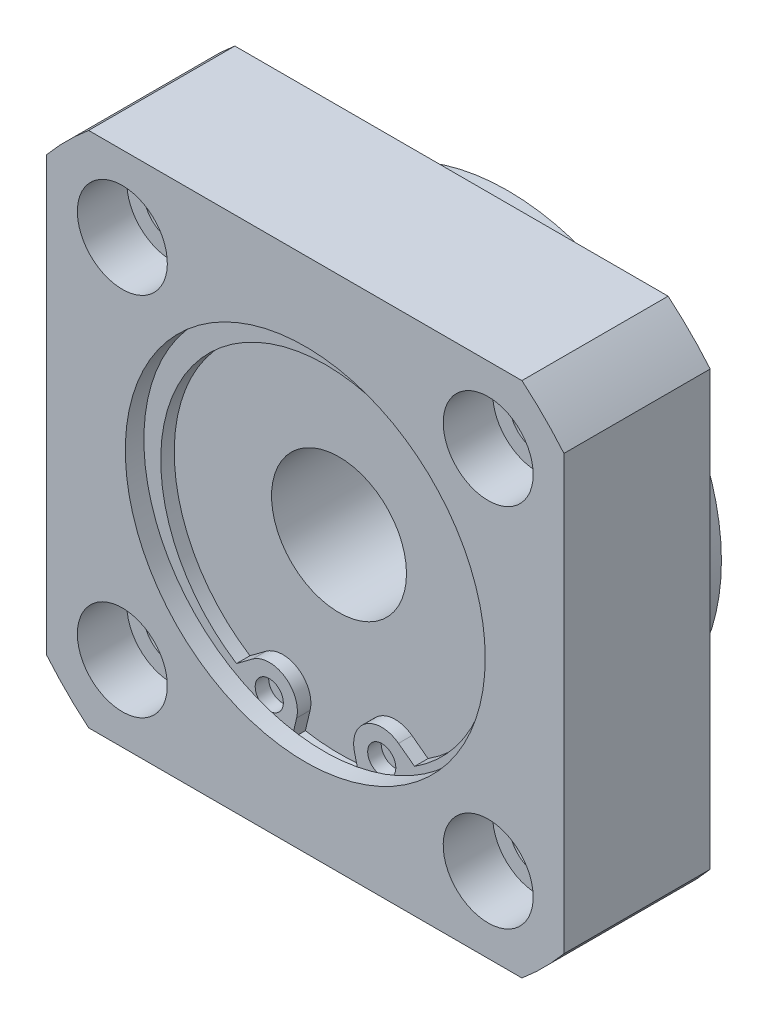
ISO-10303-21;
HEADER;
FILE_DESCRIPTION(('STEP AP214'),'2;1');
FILE_NAME('part.step','',(''),(''),'','','');
FILE_SCHEMA(('AUTOMOTIVE_DESIGN { 1 0 10303 214 1 1 1 1 }'));
ENDSEC;
DATA;
#1=APPLICATION_CONTEXT('core data for automotive mechanical design processes');
#2=APPLICATION_PROTOCOL_DEFINITION('international standard','automotive_design',2000,#1);
#3=PRODUCT_CONTEXT('',#1,'mechanical');
#4=PRODUCT('Part','Part','',(#3));
#5=PRODUCT_RELATED_PRODUCT_CATEGORY('part','',(#4));
#6=PRODUCT_DEFINITION_FORMATION('','',#4);
#7=PRODUCT_DEFINITION_CONTEXT('part definition',#1,'design');
#8=PRODUCT_DEFINITION('design','',#6,#7);
#9=PRODUCT_DEFINITION_SHAPE('','',#8);
#10=(LENGTH_UNIT() NAMED_UNIT(*) SI_UNIT(.MILLI.,.METRE.));
#11=(NAMED_UNIT(*) PLANE_ANGLE_UNIT() SI_UNIT($,.RADIAN.));
#12=(NAMED_UNIT(*) SI_UNIT($,.STERADIAN.) SOLID_ANGLE_UNIT());
#13=UNCERTAINTY_MEASURE_WITH_UNIT(LENGTH_MEASURE(1.E-05),#10,'distance_accuracy_value','');
#14=(GEOMETRIC_REPRESENTATION_CONTEXT(3) GLOBAL_UNCERTAINTY_ASSIGNED_CONTEXT((#13)) GLOBAL_UNIT_ASSIGNED_CONTEXT((#10,
#11,#12)) REPRESENTATION_CONTEXT('',''));
#15=CARTESIAN_POINT('',(0.,0.,0.));
#16=DIRECTION('',(0.,0.,1.));
#17=DIRECTION('',(1.,0.,0.));
#18=AXIS2_PLACEMENT_3D('',#15,#16,#17);
#19=CARTESIAN_POINT('',(0.,0.,10.));
#20=DIRECTION('',(0.,0.,1.));
#21=DIRECTION('',(1.,0.,0.));
#22=AXIS2_PLACEMENT_3D('',#19,#20,#21);
#23=PLANE('',#22);
#24=CARTESIAN_POINT('',(5.,-14.2233767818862,10.));
#25=DIRECTION('',(0.,0.,1.));
#26=DIRECTION('',(1.,0.,0.));
#27=AXIS2_PLACEMENT_3D('',#24,#25,#26);
#28=CIRCLE('',#27,1.25);
#29=CARTESIAN_POINT('',(6.25,-14.2233767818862,10.));
#30=VERTEX_POINT('',#29);
#31=EDGE_CURVE('E169',#30,#30,#28,.T.);
#32=ORIENTED_EDGE('',*,*,#31,.T.);
#33=EDGE_LOOP('',(#32));
#34=FACE_BOUND('',#33,.T.);
#35=ADVANCED_FACE('F14',(#34),#23,.T.);
#36=CARTESIAN_POINT('',(-5.,-14.2233767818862,10.));
#37=DIRECTION('',(0.,0.,-1.));
#38=DIRECTION('',(1.,0.,0.));
#39=AXIS2_PLACEMENT_3D('',#36,#37,#38);
#40=CIRCLE('',#39,1.25);
#41=CARTESIAN_POINT('',(-3.75,-14.2233767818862,10.));
#42=VERTEX_POINT('',#41);
#43=EDGE_CURVE('E179',#42,#42,#40,.T.);
#44=ORIENTED_EDGE('',*,*,#43,.F.);
#45=EDGE_LOOP('',(#44));
#46=FACE_BOUND('',#45,.T.);
#47=ADVANCED_FACE('F384',(#46),#23,.T.);
#48=CARTESIAN_POINT('',(16.2634559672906,16.2634559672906,0.));
#49=DIRECTION('',(0.,0.,1.));
#50=DIRECTION('',(1.,0.,0.));
#51=AXIS2_PLACEMENT_3D('',#48,#49,#50);
#52=CYLINDRICAL_SURFACE('',#51,2.5);
#53=CARTESIAN_POINT('',(16.2634559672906,16.2634559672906,0.));
#54=DIRECTION('',(0.,0.,1.));
#55=DIRECTION('',(1.,0.,0.));
#56=AXIS2_PLACEMENT_3D('',#53,#54,#55);
#57=CIRCLE('',#56,2.5);
#58=CARTESIAN_POINT('',(18.7634559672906,16.2634559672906,0.));
#59=VERTEX_POINT('',#58);
#60=EDGE_CURVE('E283',#59,#59,#57,.T.);
#61=ORIENTED_EDGE('',*,*,#60,.F.);
#62=EDGE_LOOP('',(#61));
#63=FACE_BOUND('',#62,.T.);
#64=CARTESIAN_POINT('',(16.2634559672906,16.2634559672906,8.6));
#65=DIRECTION('',(0.,0.,1.));
#66=DIRECTION('',(1.,0.,0.));
#67=AXIS2_PLACEMENT_3D('',#64,#65,#66);
#68=CIRCLE('',#67,2.5);
#69=CARTESIAN_POINT('',(18.7634559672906,16.2634559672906,8.6));
#70=VERTEX_POINT('',#69);
#71=EDGE_CURVE('E282',#70,#70,#68,.F.);
#72=ORIENTED_EDGE('',*,*,#71,.F.);
#73=EDGE_LOOP('',(#72));
#74=FACE_BOUND('',#73,.T.);
#75=ADVANCED_FACE('F392',(#63,#74),#52,.F.);
#76=CARTESIAN_POINT('',(16.2634559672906,-16.2634559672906,0.));
#77=DIRECTION('',(0.,0.,1.));
#78=DIRECTION('',(1.,0.,0.));
#79=AXIS2_PLACEMENT_3D('',#76,#77,#78);
#80=CYLINDRICAL_SURFACE('',#79,2.5);
#81=CARTESIAN_POINT('',(16.2634559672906,-16.2634559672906,0.));
#82=DIRECTION('',(0.,0.,1.));
#83=DIRECTION('',(0.,-1.,0.));
#84=AXIS2_PLACEMENT_3D('',#81,#82,#83);
#85=CIRCLE('',#84,2.5);
#86=CARTESIAN_POINT('',(16.2634559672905,-18.7634559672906,0.));
#87=VERTEX_POINT('',#86);
#88=EDGE_CURVE('E273',#87,#87,#85,.T.);
#89=ORIENTED_EDGE('',*,*,#88,.F.);
#90=EDGE_LOOP('',(#89));
#91=FACE_BOUND('',#90,.T.);
#92=CARTESIAN_POINT('',(16.2634559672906,-16.2634559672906,8.6));
#93=DIRECTION('',(0.,0.,1.));
#94=DIRECTION('',(1.,0.,0.));
#95=AXIS2_PLACEMENT_3D('',#92,#93,#94);
#96=CIRCLE('',#95,2.5);
#97=CARTESIAN_POINT('',(18.7634559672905,-16.2634559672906,8.6));
#98=VERTEX_POINT('',#97);
#99=EDGE_CURVE('E266',#98,#98,#96,.F.);
#100=ORIENTED_EDGE('',*,*,#99,.F.);
#101=EDGE_LOOP('',(#100));
#102=FACE_BOUND('',#101,.T.);
#103=ADVANCED_FACE('F779',(#91,#102),#80,.F.);
#104=CARTESIAN_POINT('',(-16.2634559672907,-16.2634559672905,0.));
#105=DIRECTION('',(0.,0.,1.));
#106=DIRECTION('',(1.,0.,0.));
#107=AXIS2_PLACEMENT_3D('',#104,#105,#106);
#108=CYLINDRICAL_SURFACE('',#107,2.5);
#109=CARTESIAN_POINT('',(-16.2634559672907,-16.2634559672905,0.));
#110=DIRECTION('',(0.,0.,1.));
#111=DIRECTION('',(-1.,0.,0.));
#112=AXIS2_PLACEMENT_3D('',#109,#110,#111);
#113=CIRCLE('',#112,2.5);
#114=CARTESIAN_POINT('',(-18.7634559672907,-16.2634559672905,0.));
#115=VERTEX_POINT('',#114);
#116=EDGE_CURVE('E270',#115,#115,#113,.T.);
#117=ORIENTED_EDGE('',*,*,#116,.F.);
#118=EDGE_LOOP('',(#117));
#119=FACE_BOUND('',#118,.T.);
#120=CARTESIAN_POINT('',(-16.2634559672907,-16.2634559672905,8.6));
#121=DIRECTION('',(0.,0.,1.));
#122=DIRECTION('',(1.,0.,0.));
#123=AXIS2_PLACEMENT_3D('',#120,#121,#122);
#124=CIRCLE('',#123,2.5);
#125=CARTESIAN_POINT('',(-13.7634559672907,-16.2634559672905,8.6));
#126=VERTEX_POINT('',#125);
#127=EDGE_CURVE('E259',#126,#126,#124,.F.);
#128=ORIENTED_EDGE('',*,*,#127,.F.);
#129=EDGE_LOOP('',(#128));
#130=FACE_BOUND('',#129,.T.);
#131=ADVANCED_FACE('F769',(#119,#130),#108,.F.);
#132=CARTESIAN_POINT('',(-16.2634559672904,16.2634559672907,0.));
#133=DIRECTION('',(0.,0.,1.));
#134=DIRECTION('',(1.,0.,0.));
#135=AXIS2_PLACEMENT_3D('',#132,#133,#134);
#136=CYLINDRICAL_SURFACE('',#135,2.5);
#137=CARTESIAN_POINT('',(-16.2634559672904,16.2634559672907,0.));
#138=DIRECTION('',(0.,0.,1.));
#139=DIRECTION('',(0.,1.,0.));
#140=AXIS2_PLACEMENT_3D('',#137,#138,#139);
#141=CIRCLE('',#140,2.5);
#142=CARTESIAN_POINT('',(-16.2634559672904,18.7634559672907,0.));
#143=VERTEX_POINT('',#142);
#144=EDGE_CURVE('E267',#143,#143,#141,.T.);
#145=ORIENTED_EDGE('',*,*,#144,.F.);
#146=EDGE_LOOP('',(#145));
#147=FACE_BOUND('',#146,.T.);
#148=CARTESIAN_POINT('',(-16.2634559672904,16.2634559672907,8.6));
#149=DIRECTION('',(0.,0.,1.));
#150=DIRECTION('',(1.,0.,0.));
#151=AXIS2_PLACEMENT_3D('',#148,#149,#150);
#152=CIRCLE('',#151,2.5);
#153=CARTESIAN_POINT('',(-13.7634559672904,16.2634559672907,8.6));
#154=VERTEX_POINT('',#153);
#155=EDGE_CURVE('E252',#154,#154,#152,.F.);
#156=ORIENTED_EDGE('',*,*,#155,.F.);
#157=EDGE_LOOP('',(#156));
#158=FACE_BOUND('',#157,.T.);
#159=ADVANCED_FACE('F760',(#147,#158),#136,.F.);
#160=CARTESIAN_POINT('',(0.,0.,0.));
#161=DIRECTION('',(0.,0.,-1.));
#162=DIRECTION('',(-1.,0.,0.));
#163=AXIS2_PLACEMENT_3D('',#160,#161,#162);
#164=PLANE('',#163);
#165=CARTESIAN_POINT('',(0.,0.,0.));
#166=DIRECTION('',(0.,0.,-1.));
#167=DIRECTION('',(-1.,0.,0.));
#168=AXIS2_PLACEMENT_3D('',#165,#166,#167);
#169=CIRCLE('',#168,19.);
#170=CARTESIAN_POINT('',(-19.,0.,0.));
#171=VERTEX_POINT('',#170);
#172=EDGE_CURVE('E194',#171,#171,#169,.T.);
#173=ORIENTED_EDGE('',*,*,#172,.F.);
#174=EDGE_LOOP('',(#173));
#175=FACE_BOUND('',#174,.T.);
#176=ORIENTED_EDGE('',*,*,#144,.T.);
#177=EDGE_LOOP('',(#176));
#178=FACE_BOUND('',#177,.T.);
#179=ORIENTED_EDGE('',*,*,#116,.T.);
#180=EDGE_LOOP('',(#179));
#181=FACE_BOUND('',#180,.T.);
#182=ORIENTED_EDGE('',*,*,#88,.T.);
#183=EDGE_LOOP('',(#182));
#184=FACE_BOUND('',#183,.T.);
#185=ORIENTED_EDGE('',*,*,#60,.T.);
#186=EDGE_LOOP('',(#185));
#187=FACE_BOUND('',#186,.T.);
#188=CARTESIAN_POINT('',(0.,0.,0.));
#189=DIRECTION('',(0.,0.,-1.));
#190=DIRECTION('',(-1.,0.,0.));
#191=AXIS2_PLACEMENT_3D('',#188,#189,#190);
#192=CIRCLE('',#191,30.);
#193=CARTESIAN_POINT('',(23.,-19.2613602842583,0.));
#194=VERTEX_POINT('',#193);
#195=CARTESIAN_POINT('',(19.2613602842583,-23.,0.));
#196=VERTEX_POINT('',#195);
#197=EDGE_CURVE('E289',#194,#196,#192,.T.);
#198=ORIENTED_EDGE('',*,*,#197,.T.);
#199=DIRECTION('',(1.,0.,0.));
#200=VECTOR('',#199,1.);
#201=CARTESIAN_POINT('',(-19.2613602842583,-23.,0.));
#202=LINE('',#201,#200);
#203=CARTESIAN_POINT('',(-19.2613602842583,-23.,0.));
#204=VERTEX_POINT('',#203);
#205=EDGE_CURVE('E292',#204,#196,#202,.T.);
#206=ORIENTED_EDGE('',*,*,#205,.F.);
#207=CARTESIAN_POINT('',(0.,0.,0.));
#208=DIRECTION('',(0.,0.,1.));
#209=DIRECTION('',(1.,0.,0.));
#210=AXIS2_PLACEMENT_3D('',#207,#208,#209);
#211=CIRCLE('',#210,30.);
#212=CARTESIAN_POINT('',(-23.,-19.2613602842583,0.));
#213=VERTEX_POINT('',#212);
#214=EDGE_CURVE('E295',#213,#204,#211,.T.);
#215=ORIENTED_EDGE('',*,*,#214,.F.);
#216=DIRECTION('',(0.,-1.,0.));
#217=VECTOR('',#216,1.);
#218=CARTESIAN_POINT('',(-23.,19.2613602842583,0.));
#219=LINE('',#218,#217);
#220=CARTESIAN_POINT('',(-23.,19.2613602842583,0.));
#221=VERTEX_POINT('',#220);
#222=EDGE_CURVE('E298',#221,#213,#219,.T.);
#223=ORIENTED_EDGE('',*,*,#222,.F.);
#224=CARTESIAN_POINT('',(0.,0.,0.));
#225=DIRECTION('',(0.,0.,-1.));
#226=DIRECTION('',(-1.,0.,0.));
#227=AXIS2_PLACEMENT_3D('',#224,#225,#226);
#228=CIRCLE('',#227,30.);
#229=CARTESIAN_POINT('',(-19.2613602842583,23.,0.));
#230=VERTEX_POINT('',#229);
#231=EDGE_CURVE('E301',#221,#230,#228,.T.);
#232=ORIENTED_EDGE('',*,*,#231,.T.);
#233=DIRECTION('',(1.,0.,0.));
#234=VECTOR('',#233,1.);
#235=CARTESIAN_POINT('',(-19.2613602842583,23.,0.));
#236=LINE('',#235,#234);
#237=CARTESIAN_POINT('',(19.2613602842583,23.,0.));
#238=VERTEX_POINT('',#237);
#239=EDGE_CURVE('E304',#230,#238,#236,.T.);
#240=ORIENTED_EDGE('',*,*,#239,.T.);
#241=CARTESIAN_POINT('',(0.,0.,0.));
#242=DIRECTION('',(0.,0.,1.));
#243=DIRECTION('',(1.,0.,0.));
#244=AXIS2_PLACEMENT_3D('',#241,#242,#243);
#245=CIRCLE('',#244,30.);
#246=CARTESIAN_POINT('',(23.,19.2613602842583,0.));
#247=VERTEX_POINT('',#246);
#248=EDGE_CURVE('E307',#247,#238,#245,.T.);
#249=ORIENTED_EDGE('',*,*,#248,.F.);
#250=DIRECTION('',(0.,-1.,0.));
#251=VECTOR('',#250,1.);
#252=CARTESIAN_POINT('',(23.,19.2613602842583,0.));
#253=LINE('',#252,#251);
#254=EDGE_CURVE('E310',#247,#194,#253,.T.);
#255=ORIENTED_EDGE('',*,*,#254,.T.);
#256=EDGE_LOOP('',(#198,#206,#215,#223,#232,#240,#249,#255));
#257=FACE_BOUND('',#256,.T.);
#258=ADVANCED_FACE('F380',(#175,#178,#181,#184,#187,#257),#164,.T.);
#259=CARTESIAN_POINT('',(16.2634559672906,16.2634559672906,8.6));
#260=DIRECTION('',(0.,0.,1.));
#261=DIRECTION('',(1.,0.,0.));
#262=AXIS2_PLACEMENT_3D('',#259,#260,#261);
#263=PLANE('',#262);
#264=CARTESIAN_POINT('',(16.2634559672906,16.2634559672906,8.6));
#265=DIRECTION('',(0.,0.,1.));
#266=DIRECTION('',(1.,0.,0.));
#267=AXIS2_PLACEMENT_3D('',#264,#265,#266);
#268=CIRCLE('',#267,4.);
#269=CARTESIAN_POINT('',(20.2634559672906,16.2634559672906,8.6));
#270=VERTEX_POINT('',#269);
#271=EDGE_CURVE('E279',#270,#270,#268,.T.);
#272=ORIENTED_EDGE('',*,*,#271,.T.);
#273=EDGE_LOOP('',(#272));
#274=FACE_BOUND('',#273,.T.);
#275=ORIENTED_EDGE('',*,*,#71,.T.);
#276=EDGE_LOOP('',(#275));
#277=FACE_BOUND('',#276,.T.);
#278=ADVANCED_FACE('F741',(#274,#277),#263,.T.);
#279=CARTESIAN_POINT('',(16.2634559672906,-16.2634559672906,8.6));
#280=DIRECTION('',(0.,0.,1.));
#281=DIRECTION('',(0.,-1.,0.));
#282=AXIS2_PLACEMENT_3D('',#279,#280,#281);
#283=PLANE('',#282);
#284=CARTESIAN_POINT('',(16.2634559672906,-16.2634559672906,8.6));
#285=DIRECTION('',(0.,0.,1.));
#286=DIRECTION('',(0.,-1.,0.));
#287=AXIS2_PLACEMENT_3D('',#284,#285,#286);
#288=CIRCLE('',#287,4.);
#289=CARTESIAN_POINT('',(16.2634559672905,-20.2634559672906,8.6));
#290=VERTEX_POINT('',#289);
#291=EDGE_CURVE('E263',#290,#290,#288,.T.);
#292=ORIENTED_EDGE('',*,*,#291,.T.);
#293=EDGE_LOOP('',(#292));
#294=FACE_BOUND('',#293,.T.);
#295=ORIENTED_EDGE('',*,*,#99,.T.);
#296=EDGE_LOOP('',(#295));
#297=FACE_BOUND('',#296,.T.);
#298=ADVANCED_FACE('F731',(#294,#297),#283,.T.);
#299=CARTESIAN_POINT('',(-16.2634559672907,-16.2634559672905,8.6));
#300=DIRECTION('',(0.,0.,1.));
#301=DIRECTION('',(-1.,0.,0.));
#302=AXIS2_PLACEMENT_3D('',#299,#300,#301);
#303=PLANE('',#302);
#304=CARTESIAN_POINT('',(-16.2634559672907,-16.2634559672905,8.6));
#305=DIRECTION('',(0.,0.,1.));
#306=DIRECTION('',(-1.,0.,0.));
#307=AXIS2_PLACEMENT_3D('',#304,#305,#306);
#308=CIRCLE('',#307,4.);
#309=CARTESIAN_POINT('',(-20.2634559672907,-16.2634559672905,8.6));
#310=VERTEX_POINT('',#309);
#311=EDGE_CURVE('E256',#310,#310,#308,.T.);
#312=ORIENTED_EDGE('',*,*,#311,.T.);
#313=EDGE_LOOP('',(#312));
#314=FACE_BOUND('',#313,.T.);
#315=ORIENTED_EDGE('',*,*,#127,.T.);
#316=EDGE_LOOP('',(#315));
#317=FACE_BOUND('',#316,.T.);
#318=ADVANCED_FACE('F721',(#314,#317),#303,.T.);
#319=CARTESIAN_POINT('',(-16.2634559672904,16.2634559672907,8.6));
#320=DIRECTION('',(0.,0.,1.));
#321=DIRECTION('',(0.,1.,0.));
#322=AXIS2_PLACEMENT_3D('',#319,#320,#321);
#323=PLANE('',#322);
#324=CARTESIAN_POINT('',(-16.2634559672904,16.2634559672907,8.6));
#325=DIRECTION('',(0.,0.,1.));
#326=DIRECTION('',(0.,1.,0.));
#327=AXIS2_PLACEMENT_3D('',#324,#325,#326);
#328=CIRCLE('',#327,4.);
#329=CARTESIAN_POINT('',(-16.2634559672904,20.2634559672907,8.6));
#330=VERTEX_POINT('',#329);
#331=EDGE_CURVE('E249',#330,#330,#328,.T.);
#332=ORIENTED_EDGE('',*,*,#331,.T.);
#333=EDGE_LOOP('',(#332));
#334=FACE_BOUND('',#333,.T.);
#335=ORIENTED_EDGE('',*,*,#155,.T.);
#336=EDGE_LOOP('',(#335));
#337=FACE_BOUND('',#336,.T.);
#338=ADVANCED_FACE('F712',(#334,#337),#323,.T.);
#339=CARTESIAN_POINT('',(0.,0.,-5.));
#340=DIRECTION('',(0.,0.,1.));
#341=DIRECTION('',(1.,0.,0.));
#342=AXIS2_PLACEMENT_3D('',#339,#340,#341);
#343=CYLINDRICAL_SURFACE('',#342,19.);
#344=CARTESIAN_POINT('',(0.,0.,-5.));
#345=DIRECTION('',(0.,0.,-1.));
#346=DIRECTION('',(-1.,0.,0.));
#347=AXIS2_PLACEMENT_3D('',#344,#345,#346);
#348=CIRCLE('',#347,19.);
#349=CARTESIAN_POINT('',(-19.,0.,-5.));
#350=VERTEX_POINT('',#349);
#351=EDGE_CURVE('E237',#350,#350,#348,.T.);
#352=ORIENTED_EDGE('',*,*,#351,.F.);
#353=EDGE_LOOP('',(#352));
#354=FACE_BOUND('',#353,.T.);
#355=ORIENTED_EDGE('',*,*,#172,.T.);
#356=EDGE_LOOP('',(#355));
#357=FACE_BOUND('',#356,.T.);
#358=ADVANCED_FACE('F702',(#354,#357),#343,.T.);
#359=CARTESIAN_POINT('',(-19.2613602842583,-23.,13.));
#360=DIRECTION('',(0.,1.,0.));
#361=DIRECTION('',(0.,0.,1.));
#362=AXIS2_PLACEMENT_3D('',#359,#360,#361);
#363=PLANE('',#362);
#364=DIRECTION('',(1.,0.,0.));
#365=VECTOR('',#364,1.);
#366=CARTESIAN_POINT('',(-19.2613602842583,-23.,13.));
#367=LINE('',#366,#365);
#368=CARTESIAN_POINT('',(-19.2613602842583,-23.,13.));
#369=VERTEX_POINT('',#368);
#370=CARTESIAN_POINT('',(19.2613602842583,-23.,13.));
#371=VERTEX_POINT('',#370);
#372=EDGE_CURVE('E315',#369,#371,#367,.T.);
#373=ORIENTED_EDGE('',*,*,#372,.F.);
#374=DIRECTION('',(0.,0.,-1.));
#375=VECTOR('',#374,1.);
#376=CARTESIAN_POINT('',(-19.2613602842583,-23.,13.));
#377=LINE('',#376,#375);
#378=EDGE_CURVE('E337',#369,#204,#377,.T.);
#379=ORIENTED_EDGE('',*,*,#378,.T.);
#380=ORIENTED_EDGE('',*,*,#205,.T.);
#381=DIRECTION('',(0.,0.,-1.));
#382=VECTOR('',#381,1.);
#383=CARTESIAN_POINT('',(19.2613602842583,-23.,13.));
#384=LINE('',#383,#382);
#385=EDGE_CURVE('E335',#371,#196,#384,.T.);
#386=ORIENTED_EDGE('',*,*,#385,.F.);
#387=EDGE_LOOP('',(#373,#379,#380,#386));
#388=FACE_BOUND('',#387,.T.);
#389=ADVANCED_FACE('F692',(#388),#363,.F.);
#390=CARTESIAN_POINT('',(0.,0.,13.));
#391=DIRECTION('',(0.,0.,-1.));
#392=DIRECTION('',(-1.,0.,0.));
#393=AXIS2_PLACEMENT_3D('',#390,#391,#392);
#394=CYLINDRICAL_SURFACE('',#393,30.);
#395=ORIENTED_EDGE('',*,*,#378,.F.);
#396=CARTESIAN_POINT('',(0.,0.,13.));
#397=DIRECTION('',(0.,0.,1.));
#398=DIRECTION('',(1.,0.,0.));
#399=AXIS2_PLACEMENT_3D('',#396,#397,#398);
#400=CIRCLE('',#399,30.);
#401=CARTESIAN_POINT('',(-23.,-19.2613602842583,13.));
#402=VERTEX_POINT('',#401);
#403=EDGE_CURVE('E318',#402,#369,#400,.T.);
#404=ORIENTED_EDGE('',*,*,#403,.F.);
#405=DIRECTION('',(0.,0.,-1.));
#406=VECTOR('',#405,1.);
#407=CARTESIAN_POINT('',(-23.,-19.2613602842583,13.));
#408=LINE('',#407,#406);
#409=EDGE_CURVE('E339',#402,#213,#408,.T.);
#410=ORIENTED_EDGE('',*,*,#409,.T.);
#411=ORIENTED_EDGE('',*,*,#214,.T.);
#412=EDGE_LOOP('',(#395,#404,#410,#411));
#413=FACE_BOUND('',#412,.T.);
#414=ADVANCED_FACE('F682',(#413),#394,.T.);
#415=CARTESIAN_POINT('',(-23.,19.2613602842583,13.));
#416=DIRECTION('',(1.,0.,0.));
#417=DIRECTION('',(0.,0.,-1.));
#418=AXIS2_PLACEMENT_3D('',#415,#416,#417);
#419=PLANE('',#418);
#420=ORIENTED_EDGE('',*,*,#409,.F.);
#421=DIRECTION('',(0.,-1.,0.));
#422=VECTOR('',#421,1.);
#423=CARTESIAN_POINT('',(-23.,19.2613602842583,13.));
#424=LINE('',#423,#422);
#425=CARTESIAN_POINT('',(-23.,19.2613602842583,13.));
#426=VERTEX_POINT('',#425);
#427=EDGE_CURVE('E321',#426,#402,#424,.T.);
#428=ORIENTED_EDGE('',*,*,#427,.F.);
#429=DIRECTION('',(0.,0.,-1.));
#430=VECTOR('',#429,1.);
#431=CARTESIAN_POINT('',(-23.,19.2613602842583,13.));
#432=LINE('',#431,#430);
#433=EDGE_CURVE('E341',#426,#221,#432,.T.);
#434=ORIENTED_EDGE('',*,*,#433,.T.);
#435=ORIENTED_EDGE('',*,*,#222,.T.);
#436=EDGE_LOOP('',(#420,#428,#434,#435));
#437=FACE_BOUND('',#436,.T.);
#438=ADVANCED_FACE('F672',(#437),#419,.F.);
#439=CARTESIAN_POINT('',(0.,0.,13.));
#440=DIRECTION('',(0.,0.,-1.));
#441=DIRECTION('',(-1.,0.,0.));
#442=AXIS2_PLACEMENT_3D('',#439,#440,#441);
#443=CYLINDRICAL_SURFACE('',#442,30.);
#444=ORIENTED_EDGE('',*,*,#433,.F.);
#445=CARTESIAN_POINT('',(0.,0.,13.));
#446=DIRECTION('',(0.,0.,-1.));
#447=DIRECTION('',(-1.,0.,0.));
#448=AXIS2_PLACEMENT_3D('',#445,#446,#447);
#449=CIRCLE('',#448,30.);
#450=CARTESIAN_POINT('',(-19.2613602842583,23.,13.));
#451=VERTEX_POINT('',#450);
#452=EDGE_CURVE('E324',#426,#451,#449,.T.);
#453=ORIENTED_EDGE('',*,*,#452,.T.);
#454=DIRECTION('',(0.,0.,-1.));
#455=VECTOR('',#454,1.);
#456=CARTESIAN_POINT('',(-19.2613602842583,23.,13.));
#457=LINE('',#456,#455);
#458=EDGE_CURVE('E343',#451,#230,#457,.T.);
#459=ORIENTED_EDGE('',*,*,#458,.T.);
#460=ORIENTED_EDGE('',*,*,#231,.F.);
#461=EDGE_LOOP('',(#444,#453,#459,#460));
#462=FACE_BOUND('',#461,.T.);
#463=ADVANCED_FACE('F662',(#462),#443,.T.);
#464=CARTESIAN_POINT('',(-19.2613602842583,23.,13.));
#465=DIRECTION('',(0.,1.,0.));
#466=DIRECTION('',(0.,0.,1.));
#467=AXIS2_PLACEMENT_3D('',#464,#465,#466);
#468=PLANE('',#467);
#469=ORIENTED_EDGE('',*,*,#458,.F.);
#470=DIRECTION('',(1.,0.,0.));
#471=VECTOR('',#470,1.);
#472=CARTESIAN_POINT('',(-19.2613602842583,23.,13.));
#473=LINE('',#472,#471);
#474=CARTESIAN_POINT('',(19.2613602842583,23.,13.));
#475=VERTEX_POINT('',#474);
#476=EDGE_CURVE('E327',#451,#475,#473,.T.);
#477=ORIENTED_EDGE('',*,*,#476,.T.);
#478=DIRECTION('',(0.,0.,-1.));
#479=VECTOR('',#478,1.);
#480=CARTESIAN_POINT('',(19.2613602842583,23.,13.));
#481=LINE('',#480,#479);
#482=EDGE_CURVE('E345',#475,#238,#481,.T.);
#483=ORIENTED_EDGE('',*,*,#482,.T.);
#484=ORIENTED_EDGE('',*,*,#239,.F.);
#485=EDGE_LOOP('',(#469,#477,#483,#484));
#486=FACE_BOUND('',#485,.T.);
#487=ADVANCED_FACE('F653',(#486),#468,.T.);
#488=CARTESIAN_POINT('',(0.,0.,13.));
#489=DIRECTION('',(0.,0.,-1.));
#490=DIRECTION('',(-1.,0.,0.));
#491=AXIS2_PLACEMENT_3D('',#488,#489,#490);
#492=CYLINDRICAL_SURFACE('',#491,30.);
#493=ORIENTED_EDGE('',*,*,#482,.F.);
#494=CARTESIAN_POINT('',(0.,0.,13.));
#495=DIRECTION('',(0.,0.,1.));
#496=DIRECTION('',(1.,0.,0.));
#497=AXIS2_PLACEMENT_3D('',#494,#495,#496);
#498=CIRCLE('',#497,30.);
#499=CARTESIAN_POINT('',(23.,19.2613602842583,13.));
#500=VERTEX_POINT('',#499);
#501=EDGE_CURVE('E330',#500,#475,#498,.T.);
#502=ORIENTED_EDGE('',*,*,#501,.F.);
#503=DIRECTION('',(0.,0.,-1.));
#504=VECTOR('',#503,1.);
#505=CARTESIAN_POINT('',(23.,19.2613602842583,13.));
#506=LINE('',#505,#504);
#507=EDGE_CURVE('E82',#500,#247,#506,.T.);
#508=ORIENTED_EDGE('',*,*,#507,.T.);
#509=ORIENTED_EDGE('',*,*,#248,.T.);
#510=EDGE_LOOP('',(#493,#502,#508,#509));
#511=FACE_BOUND('',#510,.T.);
#512=ADVANCED_FACE('F645',(#511),#492,.T.);
#513=CARTESIAN_POINT('',(23.,19.2613602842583,13.));
#514=DIRECTION('',(1.,0.,0.));
#515=DIRECTION('',(0.,0.,-1.));
#516=AXIS2_PLACEMENT_3D('',#513,#514,#515);
#517=PLANE('',#516);
#518=ORIENTED_EDGE('',*,*,#507,.F.);
#519=DIRECTION('',(0.,-1.,0.));
#520=VECTOR('',#519,1.);
#521=CARTESIAN_POINT('',(23.,19.2613602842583,13.));
#522=LINE('',#521,#520);
#523=CARTESIAN_POINT('',(23.,-19.2613602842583,13.));
#524=VERTEX_POINT('',#523);
#525=EDGE_CURVE('E333',#500,#524,#522,.T.);
#526=ORIENTED_EDGE('',*,*,#525,.T.);
#527=DIRECTION('',(0.,0.,-1.));
#528=VECTOR('',#527,1.);
#529=CARTESIAN_POINT('',(23.,-19.2613602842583,13.));
#530=LINE('',#529,#528);
#531=EDGE_CURVE('E89',#524,#194,#530,.T.);
#532=ORIENTED_EDGE('',*,*,#531,.T.);
#533=ORIENTED_EDGE('',*,*,#254,.F.);
#534=EDGE_LOOP('',(#518,#526,#532,#533));
#535=FACE_BOUND('',#534,.T.);
#536=ADVANCED_FACE('F16',(#535),#517,.T.);
#537=CARTESIAN_POINT('',(0.,0.,13.));
#538=DIRECTION('',(0.,0.,-1.));
#539=DIRECTION('',(-1.,0.,0.));
#540=AXIS2_PLACEMENT_3D('',#537,#538,#539);
#541=CYLINDRICAL_SURFACE('',#540,30.);
#542=ORIENTED_EDGE('',*,*,#531,.F.);
#543=CARTESIAN_POINT('',(0.,0.,13.));
#544=DIRECTION('',(0.,0.,-1.));
#545=DIRECTION('',(-1.,0.,0.));
#546=AXIS2_PLACEMENT_3D('',#543,#544,#545);
#547=CIRCLE('',#546,30.);
#548=EDGE_CURVE('E313',#524,#371,#547,.T.);
#549=ORIENTED_EDGE('',*,*,#548,.T.);
#550=ORIENTED_EDGE('',*,*,#385,.T.);
#551=ORIENTED_EDGE('',*,*,#197,.F.);
#552=EDGE_LOOP('',(#542,#549,#550,#551));
#553=FACE_BOUND('',#552,.T.);
#554=ADVANCED_FACE('F627',(#553),#541,.T.);
#555=CARTESIAN_POINT('',(16.2634559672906,16.2634559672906,8.6));
#556=DIRECTION('',(0.,0.,1.));
#557=DIRECTION('',(1.,0.,0.));
#558=AXIS2_PLACEMENT_3D('',#555,#556,#557);
#559=CYLINDRICAL_SURFACE('',#558,4.);
#560=ORIENTED_EDGE('',*,*,#271,.F.);
#561=EDGE_LOOP('',(#560));
#562=FACE_BOUND('',#561,.T.);
#563=CARTESIAN_POINT('',(16.2634559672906,16.2634559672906,13.));
#564=DIRECTION('',(0.,0.,1.));
#565=DIRECTION('',(1.,0.,0.));
#566=AXIS2_PLACEMENT_3D('',#563,#564,#565);
#567=CIRCLE('',#566,4.);
#568=CARTESIAN_POINT('',(20.2634559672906,16.2634559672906,13.));
#569=VERTEX_POINT('',#568);
#570=EDGE_CURVE('E276',#569,#569,#567,.T.);
#571=ORIENTED_EDGE('',*,*,#570,.T.);
#572=EDGE_LOOP('',(#571));
#573=FACE_BOUND('',#572,.T.);
#574=ADVANCED_FACE('F617',(#562,#573),#559,.F.);
#575=CARTESIAN_POINT('',(16.2634559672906,-16.2634559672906,8.6));
#576=DIRECTION('',(0.,0.,1.));
#577=DIRECTION('',(1.,0.,0.));
#578=AXIS2_PLACEMENT_3D('',#575,#576,#577);
#579=CYLINDRICAL_SURFACE('',#578,4.);
#580=ORIENTED_EDGE('',*,*,#291,.F.);
#581=EDGE_LOOP('',(#580));
#582=FACE_BOUND('',#581,.T.);
#583=CARTESIAN_POINT('',(16.2634559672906,-16.2634559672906,13.));
#584=DIRECTION('',(0.,0.,1.));
#585=DIRECTION('',(0.,-1.,0.));
#586=AXIS2_PLACEMENT_3D('',#583,#584,#585);
#587=CIRCLE('',#586,4.);
#588=CARTESIAN_POINT('',(16.2634559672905,-20.2634559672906,13.));
#589=VERTEX_POINT('',#588);
#590=EDGE_CURVE('E260',#589,#589,#587,.T.);
#591=ORIENTED_EDGE('',*,*,#590,.T.);
#592=EDGE_LOOP('',(#591));
#593=FACE_BOUND('',#592,.T.);
#594=ADVANCED_FACE('F607',(#582,#593),#579,.F.);
#595=CARTESIAN_POINT('',(-16.2634559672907,-16.2634559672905,8.6));
#596=DIRECTION('',(0.,0.,1.));
#597=DIRECTION('',(1.,0.,0.));
#598=AXIS2_PLACEMENT_3D('',#595,#596,#597);
#599=CYLINDRICAL_SURFACE('',#598,4.);
#600=ORIENTED_EDGE('',*,*,#311,.F.);
#601=EDGE_LOOP('',(#600));
#602=FACE_BOUND('',#601,.T.);
#603=CARTESIAN_POINT('',(-16.2634559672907,-16.2634559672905,13.));
#604=DIRECTION('',(0.,0.,1.));
#605=DIRECTION('',(-1.,0.,0.));
#606=AXIS2_PLACEMENT_3D('',#603,#604,#605);
#607=CIRCLE('',#606,4.);
#608=CARTESIAN_POINT('',(-20.2634559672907,-16.2634559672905,13.));
#609=VERTEX_POINT('',#608);
#610=EDGE_CURVE('E253',#609,#609,#607,.T.);
#611=ORIENTED_EDGE('',*,*,#610,.T.);
#612=EDGE_LOOP('',(#611));
#613=FACE_BOUND('',#612,.T.);
#614=ADVANCED_FACE('F597',(#602,#613),#599,.F.);
#615=CARTESIAN_POINT('',(-16.2634559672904,16.2634559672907,8.6));
#616=DIRECTION('',(0.,0.,1.));
#617=DIRECTION('',(1.,0.,0.));
#618=AXIS2_PLACEMENT_3D('',#615,#616,#617);
#619=CYLINDRICAL_SURFACE('',#618,4.);
#620=ORIENTED_EDGE('',*,*,#331,.F.);
#621=EDGE_LOOP('',(#620));
#622=FACE_BOUND('',#621,.T.);
#623=CARTESIAN_POINT('',(-16.2634559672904,16.2634559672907,13.));
#624=DIRECTION('',(0.,0.,1.));
#625=DIRECTION('',(0.,1.,0.));
#626=AXIS2_PLACEMENT_3D('',#623,#624,#625);
#627=CIRCLE('',#626,4.);
#628=CARTESIAN_POINT('',(-16.2634559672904,20.2634559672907,13.));
#629=VERTEX_POINT('',#628);
#630=EDGE_CURVE('E246',#629,#629,#627,.T.);
#631=ORIENTED_EDGE('',*,*,#630,.T.);
#632=EDGE_LOOP('',(#631));
#633=FACE_BOUND('',#632,.T.);
#634=ADVANCED_FACE('F587',(#622,#633),#619,.F.);
#635=CARTESIAN_POINT('',(0.,0.,-5.));
#636=DIRECTION('',(0.,0.,-1.));
#637=DIRECTION('',(-1.,0.,0.));
#638=AXIS2_PLACEMENT_3D('',#635,#636,#637);
#639=PLANE('',#638);
#640=ORIENTED_EDGE('',*,*,#351,.T.);
#641=EDGE_LOOP('',(#640));
#642=FACE_BOUND('',#641,.T.);
#643=CARTESIAN_POINT('',(0.,0.,-5.));
#644=DIRECTION('',(0.,0.,-1.));
#645=DIRECTION('',(-1.,0.,0.));
#646=AXIS2_PLACEMENT_3D('',#643,#644,#645);
#647=CIRCLE('',#646,13.);
#648=CARTESIAN_POINT('',(-13.,0.,-5.));
#649=VERTEX_POINT('',#648);
#650=EDGE_CURVE('E234',#649,#649,#647,.T.);
#651=ORIENTED_EDGE('',*,*,#650,.F.);
#652=EDGE_LOOP('',(#651));
#653=FACE_BOUND('',#652,.T.);
#654=ADVANCED_FACE('F577',(#642,#653),#639,.T.);
#655=CARTESIAN_POINT('',(0.,0.,13.));
#656=DIRECTION('',(0.,0.,-1.));
#657=DIRECTION('',(-1.,0.,0.));
#658=AXIS2_PLACEMENT_3D('',#655,#656,#657);
#659=PLANE('',#658);
#660=CARTESIAN_POINT('',(0.,0.,13.));
#661=DIRECTION('',(0.,0.,1.));
#662=DIRECTION('',(1.,0.,0.));
#663=AXIS2_PLACEMENT_3D('',#660,#661,#662);
#664=CIRCLE('',#663,16.);
#665=CARTESIAN_POINT('',(16.,0.,13.));
#666=VERTEX_POINT('',#665);
#667=EDGE_CURVE('E242',#666,#666,#664,.T.);
#668=ORIENTED_EDGE('',*,*,#667,.F.);
#669=EDGE_LOOP('',(#668));
#670=FACE_BOUND('',#669,.T.);
#671=ORIENTED_EDGE('',*,*,#630,.F.);
#672=EDGE_LOOP('',(#671));
#673=FACE_BOUND('',#672,.T.);
#674=ORIENTED_EDGE('',*,*,#610,.F.);
#675=EDGE_LOOP('',(#674));
#676=FACE_BOUND('',#675,.T.);
#677=ORIENTED_EDGE('',*,*,#590,.F.);
#678=EDGE_LOOP('',(#677));
#679=FACE_BOUND('',#678,.T.);
#680=ORIENTED_EDGE('',*,*,#570,.F.);
#681=EDGE_LOOP('',(#680));
#682=FACE_BOUND('',#681,.T.);
#683=ORIENTED_EDGE('',*,*,#548,.F.);
#684=ORIENTED_EDGE('',*,*,#525,.F.);
#685=ORIENTED_EDGE('',*,*,#501,.T.);
#686=ORIENTED_EDGE('',*,*,#476,.F.);
#687=ORIENTED_EDGE('',*,*,#452,.F.);
#688=ORIENTED_EDGE('',*,*,#427,.T.);
#689=ORIENTED_EDGE('',*,*,#403,.T.);
#690=ORIENTED_EDGE('',*,*,#372,.T.);
#691=EDGE_LOOP('',(#683,#684,#685,#686,#687,#688,#689,#690));
#692=FACE_BOUND('',#691,.T.);
#693=ADVANCED_FACE('F567',(#670,#673,#676,#679,#682,#692),#659,.F.);
#694=CARTESIAN_POINT('',(0.,0.,-5.));
#695=DIRECTION('',(0.,0.,1.));
#696=DIRECTION('',(1.,0.,0.));
#697=AXIS2_PLACEMENT_3D('',#694,#695,#696);
#698=CYLINDRICAL_SURFACE('',#697,13.);
#699=ORIENTED_EDGE('',*,*,#650,.T.);
#700=EDGE_LOOP('',(#699));
#701=FACE_BOUND('',#700,.T.);
#702=CARTESIAN_POINT('',(0.,0.,0.));
#703=DIRECTION('',(0.,0.,-1.));
#704=DIRECTION('',(-1.,0.,0.));
#705=AXIS2_PLACEMENT_3D('',#702,#703,#704);
#706=CIRCLE('',#705,13.);
#707=CARTESIAN_POINT('',(-13.,0.,0.));
#708=VERTEX_POINT('',#707);
#709=EDGE_CURVE('E231',#708,#708,#706,.T.);
#710=ORIENTED_EDGE('',*,*,#709,.F.);
#711=EDGE_LOOP('',(#710));
#712=FACE_BOUND('',#711,.T.);
#713=ADVANCED_FACE('F559',(#701,#712),#698,.F.);
#714=CARTESIAN_POINT('',(0.,0.,10.));
#715=DIRECTION('',(0.,0.,1.));
#716=DIRECTION('',(1.,0.,0.));
#717=AXIS2_PLACEMENT_3D('',#714,#715,#716);
#718=CYLINDRICAL_SURFACE('',#717,16.);
#719=CARTESIAN_POINT('',(0.,0.,11.35));
#720=DIRECTION('',(0.,0.,1.));
#721=DIRECTION('',(1.,0.,0.));
#722=AXIS2_PLACEMENT_3D('',#719,#720,#721);
#723=CIRCLE('',#722,16.);
#724=CARTESIAN_POINT('',(16.,0.,11.35));
#725=VERTEX_POINT('',#724);
#726=EDGE_CURVE('E229',#725,#725,#723,.F.);
#727=ORIENTED_EDGE('',*,*,#726,.T.);
#728=EDGE_LOOP('',(#727));
#729=FACE_BOUND('',#728,.T.);
#730=ORIENTED_EDGE('',*,*,#667,.T.);
#731=EDGE_LOOP('',(#730));
#732=FACE_BOUND('',#731,.T.);
#733=ADVANCED_FACE('F362',(#729,#732),#718,.F.);
#734=CARTESIAN_POINT('',(0.,0.,0.));
#735=DIRECTION('',(0.,0.,1.));
#736=DIRECTION('',(1.,0.,0.));
#737=AXIS2_PLACEMENT_3D('',#734,#735,#736);
#738=CIRCLE('',#737,6.);
#739=CARTESIAN_POINT('',(6.,0.,0.));
#740=VERTEX_POINT('',#739);
#741=EDGE_CURVE('E286',#740,#740,#738,.T.);
#742=ORIENTED_EDGE('',*,*,#741,.T.);
#743=EDGE_LOOP('',(#742));
#744=FACE_BOUND('',#743,.T.);
#745=ORIENTED_EDGE('',*,*,#709,.T.);
#746=EDGE_LOOP('',(#745));
#747=FACE_BOUND('',#746,.T.);
#748=ADVANCED_FACE('F367',(#744,#747),#164,.T.);
#749=CARTESIAN_POINT('',(0.,0.,11.35));
#750=DIRECTION('',(0.,0.,1.));
#751=DIRECTION('',(1.,0.,0.));
#752=AXIS2_PLACEMENT_3D('',#749,#750,#751);
#753=PLANE('',#752);
#754=CARTESIAN_POINT('',(0.,0.,11.35));
#755=DIRECTION('',(0.,0.,1.));
#756=DIRECTION('',(1.,0.,0.));
#757=AXIS2_PLACEMENT_3D('',#754,#755,#756);
#758=CIRCLE('',#757,16.85);
#759=CARTESIAN_POINT('',(16.85,0.,11.35));
#760=VERTEX_POINT('',#759);
#761=EDGE_CURVE('E226',#760,#760,#758,.T.);
#762=ORIENTED_EDGE('',*,*,#761,.F.);
#763=EDGE_LOOP('',(#762));
#764=FACE_BOUND('',#763,.T.);
#765=ORIENTED_EDGE('',*,*,#726,.F.);
#766=EDGE_LOOP('',(#765));
#767=FACE_BOUND('',#766,.T.);
#768=ADVANCED_FACE('F365',(#764,#767),#753,.F.);
#769=CARTESIAN_POINT('',(0.,0.,11.35));
#770=DIRECTION('',(0.,0.,-1.));
#771=DIRECTION('',(-1.,0.,0.));
#772=AXIS2_PLACEMENT_3D('',#769,#770,#771);
#773=CYLINDRICAL_SURFACE('',#772,16.85);
#774=ORIENTED_EDGE('',*,*,#761,.T.);
#775=EDGE_LOOP('',(#774));
#776=FACE_BOUND('',#775,.T.);
#777=DIRECTION('',(0.,0.,-1.));
#778=VECTOR('',#777,1.);
#779=CARTESIAN_POINT('',(2.99125499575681,-16.5823669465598,11.35));
#780=LINE('',#779,#778);
#781=CARTESIAN_POINT('',(2.99125499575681,-16.5823669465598,10.));
#782=VERTEX_POINT('',#781);
#783=CARTESIAN_POINT('',(2.99125499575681,-16.5823669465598,11.2));
#784=VERTEX_POINT('',#783);
#785=EDGE_CURVE('E18',#782,#784,#780,.F.);
#786=ORIENTED_EDGE('',*,*,#785,.F.);
#787=CARTESIAN_POINT('',(0.,0.,10.));
#788=DIRECTION('',(0.,0.,1.));
#789=DIRECTION('',(1.,0.,0.));
#790=AXIS2_PLACEMENT_3D('',#787,#788,#789);
#791=CIRCLE('',#790,16.85);
#792=CARTESIAN_POINT('',(-2.99125499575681,-16.5823669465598,10.));
#793=VERTEX_POINT('',#792);
#794=EDGE_CURVE('E137',#793,#782,#791,.T.);
#795=ORIENTED_EDGE('',*,*,#794,.F.);
#796=DIRECTION('',(0.,0.,-1.));
#797=VECTOR('',#796,1.);
#798=CARTESIAN_POINT('',(-2.99125499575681,-16.5823669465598,11.35));
#799=LINE('',#798,#797);
#800=CARTESIAN_POINT('',(-2.99125499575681,-16.5823669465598,11.2));
#801=VERTEX_POINT('',#800);
#802=EDGE_CURVE('E134',#801,#793,#799,.T.);
#803=ORIENTED_EDGE('',*,*,#802,.F.);
#804=CARTESIAN_POINT('',(0.,0.,11.2));
#805=DIRECTION('',(0.,0.,-1.));
#806=DIRECTION('',(-1.,0.,0.));
#807=AXIS2_PLACEMENT_3D('',#804,#805,#806);
#808=CIRCLE('',#807,16.85);
#809=EDGE_CURVE('E9',#784,#801,#808,.F.);
#810=ORIENTED_EDGE('',*,*,#809,.F.);
#811=EDGE_LOOP('',(#786,#795,#803,#810));
#812=FACE_BOUND('',#811,.T.);
#813=ADVANCED_FACE('F135',(#776,#812),#773,.F.);
#814=CARTESIAN_POINT('',(0.,0.,13.));
#815=DIRECTION('',(0.,0.,-1.));
#816=DIRECTION('',(-1.,0.,0.));
#817=AXIS2_PLACEMENT_3D('',#814,#815,#816);
#818=CYLINDRICAL_SURFACE('',#817,6.);
#819=ORIENTED_EDGE('',*,*,#741,.F.);
#820=EDGE_LOOP('',(#819));
#821=FACE_BOUND('',#820,.T.);
#822=CARTESIAN_POINT('',(0.,0.,10.));
#823=DIRECTION('',(0.,0.,1.));
#824=DIRECTION('',(1.,0.,0.));
#825=AXIS2_PLACEMENT_3D('',#822,#823,#824);
#826=CIRCLE('',#825,6.);
#827=CARTESIAN_POINT('',(6.,0.,10.));
#828=VERTEX_POINT('',#827);
#829=EDGE_CURVE('E245',#828,#828,#826,.T.);
#830=ORIENTED_EDGE('',*,*,#829,.T.);
#831=EDGE_LOOP('',(#830));
#832=FACE_BOUND('',#831,.T.);
#833=ADVANCED_FACE('F375',(#821,#832),#818,.F.);
#834=ORIENTED_EDGE('',*,*,#829,.F.);
#835=EDGE_LOOP('',(#834));
#836=FACE_BOUND('',#835,.T.);
#837=DIRECTION('',(0.231349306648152,-0.972870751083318,0.));
#838=VECTOR('',#837,1.);
#839=CARTESIAN_POINT('',(2.5678231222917,-14.8017500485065,10.));
#840=LINE('',#839,#838);
#841=CARTESIAN_POINT('',(2.5678231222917,-14.8017500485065,10.));
#842=VERTEX_POINT('',#841);
#843=EDGE_CURVE('E185',#842,#782,#840,.T.);
#844=ORIENTED_EDGE('',*,*,#843,.F.);
#845=CARTESIAN_POINT('',(5.,-14.2233767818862,10.));
#846=DIRECTION('',(0.,0.,1.));
#847=DIRECTION('',(1.,0.,0.));
#848=AXIS2_PLACEMENT_3D('',#845,#846,#847);
#849=CIRCLE('',#848,2.5);
#850=CARTESIAN_POINT('',(6.49138441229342,-12.2169439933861,10.));
#851=VERTEX_POINT('',#850);
#852=EDGE_CURVE('E184',#851,#842,#849,.T.);
#853=ORIENTED_EDGE('',*,*,#852,.F.);
#854=DIRECTION('',(-0.802573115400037,0.596553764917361,0.));
#855=VECTOR('',#854,1.);
#856=CARTESIAN_POINT('',(6.49138441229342,-12.2169439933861,10.));
#857=LINE('',#856,#855);
#858=CARTESIAN_POINT('',(7.91695293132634,-13.2765711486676,10.));
#859=VERTEX_POINT('',#858);
#860=EDGE_CURVE('E198',#859,#851,#857,.T.);
#861=ORIENTED_EDGE('',*,*,#860,.F.);
#862=CARTESIAN_POINT('',(0.,-0.95,10.));
#863=DIRECTION('',(0.,0.,-1.));
#864=DIRECTION('',(0.,-1.,0.));
#865=AXIS2_PLACEMENT_3D('',#862,#863,#864);
#866=CIRCLE('',#865,14.65);
#867=CARTESIAN_POINT('',(-7.91695293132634,-13.2765711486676,10.));
#868=VERTEX_POINT('',#867);
#869=EDGE_CURVE('E166',#868,#859,#866,.T.);
#870=ORIENTED_EDGE('',*,*,#869,.F.);
#871=DIRECTION('',(-0.802573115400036,-0.596553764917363,0.));
#872=VECTOR('',#871,1.);
#873=CARTESIAN_POINT('',(-6.49138441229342,-12.2169439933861,10.));
#874=LINE('',#873,#872);
#875=CARTESIAN_POINT('',(-6.49138441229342,-12.2169439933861,10.));
#876=VERTEX_POINT('',#875);
#877=EDGE_CURVE('E140',#876,#868,#874,.T.);
#878=ORIENTED_EDGE('',*,*,#877,.F.);
#879=CARTESIAN_POINT('',(-5.,-14.2233767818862,10.));
#880=DIRECTION('',(0.,0.,1.));
#881=DIRECTION('',(-1.,0.,0.));
#882=AXIS2_PLACEMENT_3D('',#879,#880,#881);
#883=CIRCLE('',#882,2.5);
#884=CARTESIAN_POINT('',(-2.56782312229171,-14.8017500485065,10.));
#885=VERTEX_POINT('',#884);
#886=EDGE_CURVE('E164',#885,#876,#883,.T.);
#887=ORIENTED_EDGE('',*,*,#886,.F.);
#888=DIRECTION('',(0.231349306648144,0.97287075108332,0.));
#889=VECTOR('',#888,1.);
#890=CARTESIAN_POINT('',(-2.56782312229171,-14.8017500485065,10.));
#891=LINE('',#890,#889);
#892=EDGE_CURVE('E204',#793,#885,#891,.T.);
#893=ORIENTED_EDGE('',*,*,#892,.F.);
#894=ORIENTED_EDGE('',*,*,#794,.T.);
#895=EDGE_LOOP('',(#844,#853,#861,#870,#878,#887,#893,#894));
#896=FACE_BOUND('',#895,.T.);
#897=ADVANCED_FACE('F387',(#836,#896),#23,.T.);
#898=CARTESIAN_POINT('',(0.,-0.95,11.2));
#899=DIRECTION('',(0.,0.,1.));
#900=DIRECTION('',(-1.,0.,0.));
#901=AXIS2_PLACEMENT_3D('',#898,#899,#900);
#902=CYLINDRICAL_SURFACE('',#901,14.65);
#903=ORIENTED_EDGE('',*,*,#869,.T.);
#904=DIRECTION('',(0.,0.,-1.));
#905=VECTOR('',#904,1.);
#906=CARTESIAN_POINT('',(7.91695293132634,-13.2765711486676,11.2));
#907=LINE('',#906,#905);
#908=CARTESIAN_POINT('',(7.91695293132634,-13.2765711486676,11.2));
#909=VERTEX_POINT('',#908);
#910=EDGE_CURVE('E175',#909,#859,#907,.T.);
#911=ORIENTED_EDGE('',*,*,#910,.F.);
#912=CARTESIAN_POINT('',(0.,-0.95,11.2));
#913=DIRECTION('',(0.,0.,-1.));
#914=DIRECTION('',(0.,-1.,0.));
#915=AXIS2_PLACEMENT_3D('',#912,#913,#914);
#916=CIRCLE('',#915,14.65);
#917=CARTESIAN_POINT('',(-7.91695293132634,-13.2765711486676,11.2));
#918=VERTEX_POINT('',#917);
#919=EDGE_CURVE('E176',#918,#909,#916,.T.);
#920=ORIENTED_EDGE('',*,*,#919,.F.);
#921=DIRECTION('',(0.,0.,-1.));
#922=VECTOR('',#921,1.);
#923=CARTESIAN_POINT('',(-7.91695293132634,-13.2765711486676,11.2));
#924=LINE('',#923,#922);
#925=EDGE_CURVE('E170',#918,#868,#924,.T.);
#926=ORIENTED_EDGE('',*,*,#925,.T.);
#927=EDGE_LOOP('',(#903,#911,#920,#926));
#928=FACE_BOUND('',#927,.T.);
#929=ADVANCED_FACE('F388',(#928),#902,.F.);
#930=CARTESIAN_POINT('',(6.49138441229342,-12.2169439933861,11.2));
#931=DIRECTION('',(-0.596553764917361,-0.802573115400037,0.));
#932=DIRECTION('',(-0.802573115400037,0.596553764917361,0.));
#933=AXIS2_PLACEMENT_3D('',#930,#931,#932);
#934=PLANE('',#933);
#935=ORIENTED_EDGE('',*,*,#860,.T.);
#936=DIRECTION('',(0.,0.,-1.));
#937=VECTOR('',#936,1.);
#938=CARTESIAN_POINT('',(6.49138441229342,-12.2169439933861,11.2));
#939=LINE('',#938,#937);
#940=CARTESIAN_POINT('',(6.49138441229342,-12.2169439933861,11.2));
#941=VERTEX_POINT('',#940);
#942=EDGE_CURVE('E180',#941,#851,#939,.T.);
#943=ORIENTED_EDGE('',*,*,#942,.F.);
#944=DIRECTION('',(-0.802573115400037,0.596553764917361,0.));
#945=VECTOR('',#944,1.);
#946=CARTESIAN_POINT('',(6.49138441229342,-12.2169439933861,11.2));
#947=LINE('',#946,#945);
#948=EDGE_CURVE('E186',#909,#941,#947,.T.);
#949=ORIENTED_EDGE('',*,*,#948,.F.);
#950=ORIENTED_EDGE('',*,*,#910,.T.);
#951=EDGE_LOOP('',(#935,#943,#949,#950));
#952=FACE_BOUND('',#951,.T.);
#953=ADVANCED_FACE('F400',(#952),#934,.F.);
#954=CARTESIAN_POINT('',(5.,-14.2233767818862,11.2));
#955=DIRECTION('',(0.,0.,1.));
#956=DIRECTION('',(-1.,0.,0.));
#957=AXIS2_PLACEMENT_3D('',#954,#955,#956);
#958=CYLINDRICAL_SURFACE('',#957,2.5);
#959=ORIENTED_EDGE('',*,*,#852,.T.);
#960=DIRECTION('',(0.,0.,-1.));
#961=VECTOR('',#960,1.);
#962=CARTESIAN_POINT('',(2.5678231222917,-14.8017500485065,11.2));
#963=LINE('',#962,#961);
#964=CARTESIAN_POINT('',(2.5678231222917,-14.8017500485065,11.2));
#965=VERTEX_POINT('',#964);
#966=EDGE_CURVE('E203',#965,#842,#963,.T.);
#967=ORIENTED_EDGE('',*,*,#966,.F.);
#968=CARTESIAN_POINT('',(5.,-14.2233767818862,11.2));
#969=DIRECTION('',(0.,0.,1.));
#970=DIRECTION('',(1.,0.,0.));
#971=AXIS2_PLACEMENT_3D('',#968,#969,#970);
#972=CIRCLE('',#971,2.5);
#973=EDGE_CURVE('E157',#941,#965,#972,.T.);
#974=ORIENTED_EDGE('',*,*,#973,.F.);
#975=ORIENTED_EDGE('',*,*,#942,.T.);
#976=EDGE_LOOP('',(#959,#967,#974,#975));
#977=FACE_BOUND('',#976,.T.);
#978=ADVANCED_FACE('F406',(#977),#958,.T.);
#979=CARTESIAN_POINT('',(-2.56782312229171,-14.8017500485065,11.2));
#980=DIRECTION('',(-0.97287075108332,0.231349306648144,0.));
#981=DIRECTION('',(0.,0.,1.));
#982=AXIS2_PLACEMENT_3D('',#979,#980,#981);
#983=PLANE('',#982);
#984=DIRECTION('',(0.231349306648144,0.97287075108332,0.));
#985=VECTOR('',#984,1.);
#986=CARTESIAN_POINT('',(-2.56782312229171,-14.8017500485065,11.2));
#987=LINE('',#986,#985);
#988=CARTESIAN_POINT('',(-2.56782312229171,-14.8017500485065,11.2));
#989=VERTEX_POINT('',#988);
#990=EDGE_CURVE('E102',#801,#989,#987,.T.);
#991=ORIENTED_EDGE('',*,*,#990,.F.);
#992=ORIENTED_EDGE('',*,*,#802,.T.);
#993=ORIENTED_EDGE('',*,*,#892,.T.);
#994=DIRECTION('',(0.,0.,-1.));
#995=VECTOR('',#994,1.);
#996=CARTESIAN_POINT('',(-2.56782312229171,-14.8017500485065,11.2));
#997=LINE('',#996,#995);
#998=EDGE_CURVE('E149',#989,#885,#997,.T.);
#999=ORIENTED_EDGE('',*,*,#998,.F.);
#1000=EDGE_LOOP('',(#991,#992,#993,#999));
#1001=FACE_BOUND('',#1000,.T.);
#1002=ADVANCED_FACE('F147',(#1001),#983,.F.);
#1003=CARTESIAN_POINT('',(0.,-0.95,11.2));
#1004=DIRECTION('',(0.,0.,-1.));
#1005=DIRECTION('',(0.,-1.,0.));
#1006=AXIS2_PLACEMENT_3D('',#1003,#1004,#1005);
#1007=PLANE('',#1006);
#1008=CARTESIAN_POINT('',(-5.,-14.2233767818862,11.2));
#1009=DIRECTION('',(0.,0.,-1.));
#1010=DIRECTION('',(1.,0.,0.));
#1011=AXIS2_PLACEMENT_3D('',#1008,#1009,#1010);
#1012=CIRCLE('',#1011,1.25);
#1013=CARTESIAN_POINT('',(-3.75,-14.2233767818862,11.2));
#1014=VERTEX_POINT('',#1013);
#1015=EDGE_CURVE('E160',#1014,#1014,#1012,.T.);
#1016=ORIENTED_EDGE('',*,*,#1015,.T.);
#1017=EDGE_LOOP('',(#1016));
#1018=FACE_BOUND('',#1017,.T.);
#1019=CARTESIAN_POINT('',(5.,-14.2233767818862,11.2));
#1020=DIRECTION('',(0.,0.,1.));
#1021=DIRECTION('',(1.,0.,0.));
#1022=AXIS2_PLACEMENT_3D('',#1019,#1020,#1021);
#1023=CIRCLE('',#1022,1.25);
#1024=CARTESIAN_POINT('',(6.25,-14.2233767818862,11.2));
#1025=VERTEX_POINT('',#1024);
#1026=EDGE_CURVE('E190',#1025,#1025,#1023,.T.);
#1027=ORIENTED_EDGE('',*,*,#1026,.F.);
#1028=EDGE_LOOP('',(#1027));
#1029=FACE_BOUND('',#1028,.T.);
#1030=DIRECTION('',(0.231349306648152,-0.972870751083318,0.));
#1031=VECTOR('',#1030,1.);
#1032=CARTESIAN_POINT('',(2.5678231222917,-14.8017500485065,11.2));
#1033=LINE('',#1032,#1031);
#1034=EDGE_CURVE('E145',#965,#784,#1033,.T.);
#1035=ORIENTED_EDGE('',*,*,#1034,.T.);
#1036=ORIENTED_EDGE('',*,*,#809,.T.);
#1037=ORIENTED_EDGE('',*,*,#990,.T.);
#1038=CARTESIAN_POINT('',(-5.,-14.2233767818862,11.2));
#1039=DIRECTION('',(0.,0.,1.));
#1040=DIRECTION('',(-1.,0.,0.));
#1041=AXIS2_PLACEMENT_3D('',#1038,#1039,#1040);
#1042=CIRCLE('',#1041,2.5);
#1043=CARTESIAN_POINT('',(-6.49138441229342,-12.2169439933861,11.2));
#1044=VERTEX_POINT('',#1043);
#1045=EDGE_CURVE('E151',#989,#1044,#1042,.T.);
#1046=ORIENTED_EDGE('',*,*,#1045,.T.);
#1047=DIRECTION('',(-0.802573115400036,-0.596553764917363,0.));
#1048=VECTOR('',#1047,1.);
#1049=CARTESIAN_POINT('',(-6.49138441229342,-12.2169439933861,11.2));
#1050=LINE('',#1049,#1048);
#1051=EDGE_CURVE('E171',#1044,#918,#1050,.T.);
#1052=ORIENTED_EDGE('',*,*,#1051,.T.);
#1053=ORIENTED_EDGE('',*,*,#919,.T.);
#1054=ORIENTED_EDGE('',*,*,#948,.T.);
#1055=ORIENTED_EDGE('',*,*,#973,.T.);
#1056=EDGE_LOOP('',(#1035,#1036,#1037,#1046,#1052,#1053,#1054,#1055));
#1057=FACE_BOUND('',#1056,.T.);
#1058=ADVANCED_FACE('F143',(#1018,#1029,#1057),#1007,.F.);
#1059=CARTESIAN_POINT('',(5.,-14.2233767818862,11.2));
#1060=DIRECTION('',(0.,0.,1.));
#1061=DIRECTION('',(-1.,0.,0.));
#1062=AXIS2_PLACEMENT_3D('',#1059,#1060,#1061);
#1063=CYLINDRICAL_SURFACE('',#1062,1.25);
#1064=ORIENTED_EDGE('',*,*,#31,.F.);
#1065=EDGE_LOOP('',(#1064));
#1066=FACE_BOUND('',#1065,.T.);
#1067=ORIENTED_EDGE('',*,*,#1026,.T.);
#1068=EDGE_LOOP('',(#1067));
#1069=FACE_BOUND('',#1068,.T.);
#1070=ADVANCED_FACE('F469',(#1066,#1069),#1063,.F.);
#1071=CARTESIAN_POINT('',(-5.,-14.2233767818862,11.2));
#1072=DIRECTION('',(0.,0.,1.));
#1073=DIRECTION('',(-1.,0.,0.));
#1074=AXIS2_PLACEMENT_3D('',#1071,#1072,#1073);
#1075=CYLINDRICAL_SURFACE('',#1074,1.25);
#1076=ORIENTED_EDGE('',*,*,#43,.T.);
#1077=EDGE_LOOP('',(#1076));
#1078=FACE_BOUND('',#1077,.T.);
#1079=ORIENTED_EDGE('',*,*,#1015,.F.);
#1080=EDGE_LOOP('',(#1079));
#1081=FACE_BOUND('',#1080,.T.);
#1082=ADVANCED_FACE('F466',(#1078,#1081),#1075,.F.);
#1083=CARTESIAN_POINT('',(-6.49138441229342,-12.2169439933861,11.2));
#1084=DIRECTION('',(0.596553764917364,-0.802573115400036,0.));
#1085=DIRECTION('',(0.,0.,-1.));
#1086=AXIS2_PLACEMENT_3D('',#1083,#1084,#1085);
#1087=PLANE('',#1086);
#1088=ORIENTED_EDGE('',*,*,#877,.T.);
#1089=ORIENTED_EDGE('',*,*,#925,.F.);
#1090=ORIENTED_EDGE('',*,*,#1051,.F.);
#1091=DIRECTION('',(0.,0.,-1.));
#1092=VECTOR('',#1091,1.);
#1093=CARTESIAN_POINT('',(-6.49138441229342,-12.2169439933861,11.2));
#1094=LINE('',#1093,#1092);
#1095=EDGE_CURVE('E209',#1044,#876,#1094,.T.);
#1096=ORIENTED_EDGE('',*,*,#1095,.T.);
#1097=EDGE_LOOP('',(#1088,#1089,#1090,#1096));
#1098=FACE_BOUND('',#1097,.T.);
#1099=ADVANCED_FACE('F444',(#1098),#1087,.F.);
#1100=CARTESIAN_POINT('',(-5.,-14.2233767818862,11.2));
#1101=DIRECTION('',(0.,0.,1.));
#1102=DIRECTION('',(-1.,0.,0.));
#1103=AXIS2_PLACEMENT_3D('',#1100,#1101,#1102);
#1104=CYLINDRICAL_SURFACE('',#1103,2.5);
#1105=ORIENTED_EDGE('',*,*,#886,.T.);
#1106=ORIENTED_EDGE('',*,*,#1095,.F.);
#1107=ORIENTED_EDGE('',*,*,#1045,.F.);
#1108=ORIENTED_EDGE('',*,*,#998,.T.);
#1109=EDGE_LOOP('',(#1105,#1106,#1107,#1108));
#1110=FACE_BOUND('',#1109,.T.);
#1111=ADVANCED_FACE('F459',(#1110),#1104,.T.);
#1112=CARTESIAN_POINT('',(2.5678231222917,-14.8017500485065,11.2));
#1113=DIRECTION('',(0.972870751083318,0.231349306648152,0.));
#1114=DIRECTION('',(0.,0.,-1.));
#1115=AXIS2_PLACEMENT_3D('',#1112,#1113,#1114);
#1116=PLANE('',#1115);
#1117=ORIENTED_EDGE('',*,*,#843,.T.);
#1118=ORIENTED_EDGE('',*,*,#785,.T.);
#1119=ORIENTED_EDGE('',*,*,#1034,.F.);
#1120=ORIENTED_EDGE('',*,*,#966,.T.);
#1121=EDGE_LOOP('',(#1117,#1118,#1119,#1120));
#1122=FACE_BOUND('',#1121,.T.);
#1123=ADVANCED_FACE('F394',(#1122),#1116,.F.);
#1124=CLOSED_SHELL('',(#35,#47,#75,#103,#131,#159,#258,#278,#298,#318,#338,#358,#389,#414,#438,
#463,#487,#512,#536,#554,#574,#594,#614,#634,#654,#693,#713,#733,#748,#768,#813,#833,#897,#929,
#953,#978,#1002,#1058,#1070,#1082,#1099,#1111,#1123));
#1125=MANIFOLD_SOLID_BREP('B1',#1124);
#1126=ADVANCED_BREP_SHAPE_REPRESENTATION('',(#18,#1125),#14);
#1127=SHAPE_DEFINITION_REPRESENTATION(#9,#1126);
ENDSEC;
END-ISO-10303-21;
